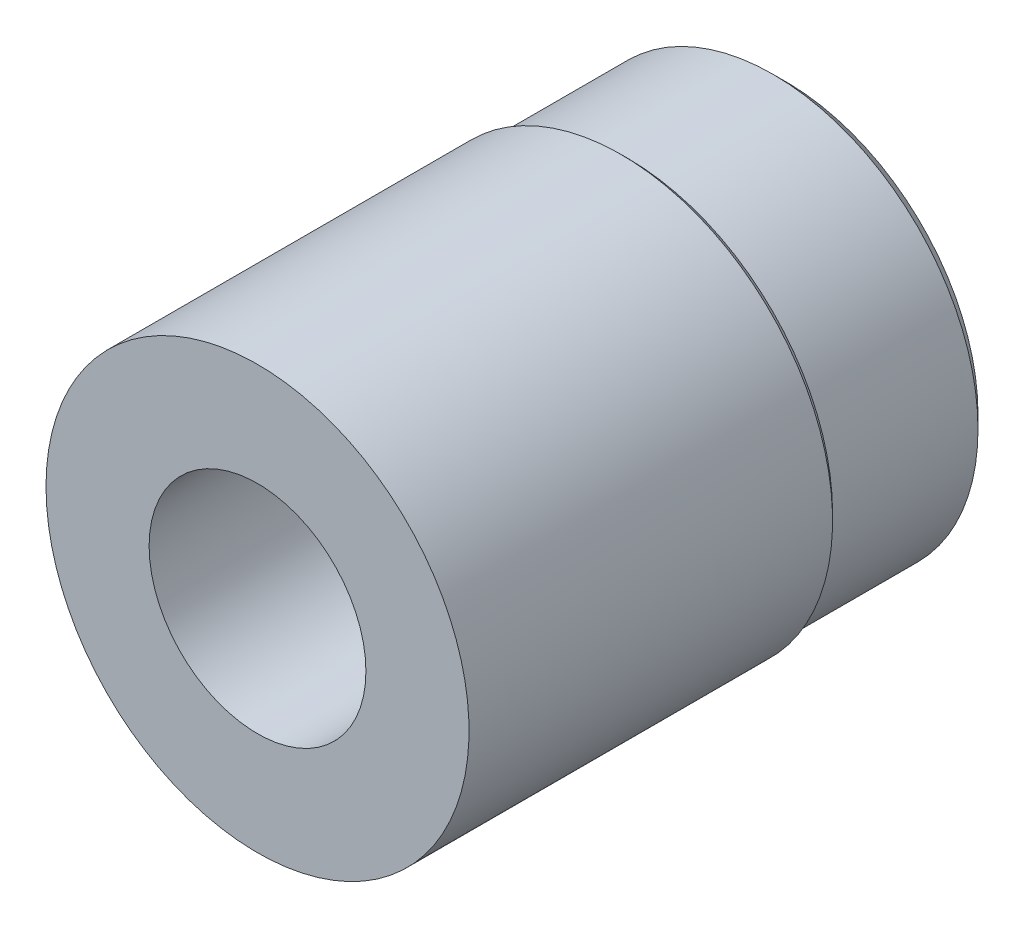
ISO-10303-21;
HEADER;
FILE_DESCRIPTION(('STEP AP214'),'2;1');
FILE_NAME('part.step','',(''),(''),'','','');
FILE_SCHEMA(('AUTOMOTIVE_DESIGN { 1 0 10303 214 1 1 1 1 }'));
ENDSEC;
DATA;
#1=APPLICATION_CONTEXT('core data for automotive mechanical design processes');
#2=APPLICATION_PROTOCOL_DEFINITION('international standard','automotive_design',2000,#1);
#3=PRODUCT_CONTEXT('',#1,'mechanical');
#4=PRODUCT('Part','Part','',(#3));
#5=PRODUCT_RELATED_PRODUCT_CATEGORY('part','',(#4));
#6=PRODUCT_DEFINITION_FORMATION('','',#4);
#7=PRODUCT_DEFINITION_CONTEXT('part definition',#1,'design');
#8=PRODUCT_DEFINITION('design','',#6,#7);
#9=PRODUCT_DEFINITION_SHAPE('','',#8);
#10=(LENGTH_UNIT() NAMED_UNIT(*) SI_UNIT(.MILLI.,.METRE.));
#11=(NAMED_UNIT(*) PLANE_ANGLE_UNIT() SI_UNIT($,.RADIAN.));
#12=(NAMED_UNIT(*) SI_UNIT($,.STERADIAN.) SOLID_ANGLE_UNIT());
#13=UNCERTAINTY_MEASURE_WITH_UNIT(LENGTH_MEASURE(1.E-05),#10,'distance_accuracy_value','');
#14=(GEOMETRIC_REPRESENTATION_CONTEXT(3) GLOBAL_UNCERTAINTY_ASSIGNED_CONTEXT((#13)) GLOBAL_UNIT_ASSIGNED_CONTEXT((#10,
#11,#12)) REPRESENTATION_CONTEXT('',''));
#15=CARTESIAN_POINT('',(0.,0.,0.));
#16=DIRECTION('',(0.,0.,1.));
#17=DIRECTION('',(1.,0.,0.));
#18=AXIS2_PLACEMENT_3D('',#15,#16,#17);
#19=CARTESIAN_POINT('',(0.,0.,-17.));
#20=DIRECTION('',(0.,0.,-1.));
#21=DIRECTION('',(-1.,0.,0.));
#22=AXIS2_PLACEMENT_3D('',#19,#20,#21);
#23=CYLINDRICAL_SURFACE('',#22,3.75000000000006);
#24=CARTESIAN_POINT('',(0.,0.,-14.));
#25=DIRECTION('',(0.,0.,-1.));
#26=DIRECTION('',(-1.,0.,0.));
#27=AXIS2_PLACEMENT_3D('',#24,#25,#26);
#28=CIRCLE('',#27,3.75000000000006);
#29=CARTESIAN_POINT('',(-3.75000000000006,0.,-14.));
#30=VERTEX_POINT('',#29);
#31=EDGE_CURVE('E17',#30,#30,#28,.T.);
#32=ORIENTED_EDGE('',*,*,#31,.F.);
#33=EDGE_LOOP('',(#32));
#34=FACE_BOUND('',#33,.T.);
#35=CARTESIAN_POINT('',(0.,0.,-20.));
#36=DIRECTION('',(0.,0.,-1.));
#37=DIRECTION('',(-1.,0.,0.));
#38=AXIS2_PLACEMENT_3D('',#35,#36,#37);
#39=CIRCLE('',#38,3.75000000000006);
#40=CARTESIAN_POINT('',(-3.75000000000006,0.,-20.));
#41=VERTEX_POINT('',#40);
#42=EDGE_CURVE('E47',#41,#41,#39,.F.);
#43=ORIENTED_EDGE('',*,*,#42,.F.);
#44=EDGE_LOOP('',(#43));
#45=FACE_BOUND('',#44,.T.);
#46=ADVANCED_FACE('F14',(#34,#45),#23,.F.);
#47=CARTESIAN_POINT('',(2.860576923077,0.,-14.));
#48=DIRECTION('',(0.,0.,-1.));
#49=DIRECTION('',(-1.,0.,0.));
#50=AXIS2_PLACEMENT_3D('',#47,#48,#49);
#51=PLANE('',#50);
#52=CARTESIAN_POINT('',(0.,0.,-14.));
#53=DIRECTION('',(0.,0.,-1.));
#54=DIRECTION('',(-1.,0.,0.));
#55=AXIS2_PLACEMENT_3D('',#52,#53,#54);
#56=CIRCLE('',#55,1.74890384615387);
#57=CARTESIAN_POINT('',(-1.74890384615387,0.,-14.));
#58=VERTEX_POINT('',#57);
#59=EDGE_CURVE('E45',#58,#58,#56,.F.);
#60=ORIENTED_EDGE('',*,*,#59,.T.);
#61=EDGE_LOOP('',(#60));
#62=FACE_BOUND('',#61,.T.);
#63=ORIENTED_EDGE('',*,*,#31,.T.);
#64=EDGE_LOOP('',(#63));
#65=FACE_BOUND('',#64,.T.);
#66=ADVANCED_FACE('F54',(#62,#65),#51,.T.);
#67=CARTESIAN_POINT('',(5.5,0.,-20.));
#68=DIRECTION('',(0.,0.,-1.));
#69=DIRECTION('',(-1.,0.,0.));
#70=AXIS2_PLACEMENT_3D('',#67,#68,#69);
#71=PLANE('',#70);
#72=ORIENTED_EDGE('',*,*,#42,.T.);
#73=EDGE_LOOP('',(#72));
#74=FACE_BOUND('',#73,.T.);
#75=CARTESIAN_POINT('',(0.,0.,-20.0000000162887));
#76=DIRECTION('',(0.,0.,1.));
#77=DIRECTION('',(1.,0.,0.));
#78=AXIS2_PLACEMENT_3D('',#75,#76,#77);
#79=CIRCLE('',#78,7.25000001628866);
#80=CARTESIAN_POINT('',(7.25000001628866,0.,-20.0000000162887));
#81=VERTEX_POINT('',#80);
#82=EDGE_CURVE('E42',#81,#81,#79,.T.);
#83=ORIENTED_EDGE('',*,*,#82,.F.);
#84=EDGE_LOOP('',(#83));
#85=FACE_BOUND('',#84,.T.);
#86=ADVANCED_FACE('F63',(#74,#85),#71,.T.);
#87=CARTESIAN_POINT('',(0.,0.,-12.8790322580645));
#88=DIRECTION('',(0.,0.,-1.));
#89=DIRECTION('',(-1.,0.,0.));
#90=AXIS2_PLACEMENT_3D('',#87,#88,#89);
#91=CYLINDRICAL_SURFACE('',#90,1.74890384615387);
#92=CARTESIAN_POINT('',(0.,0.,-11.758064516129));
#93=DIRECTION('',(0.,0.,-1.));
#94=DIRECTION('',(-1.,0.,0.));
#95=AXIS2_PLACEMENT_3D('',#92,#93,#94);
#96=CIRCLE('',#95,1.74890384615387);
#97=CARTESIAN_POINT('',(-1.74890384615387,0.,-11.758064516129));
#98=VERTEX_POINT('',#97);
#99=EDGE_CURVE('E39',#98,#98,#96,.T.);
#100=ORIENTED_EDGE('',*,*,#99,.F.);
#101=EDGE_LOOP('',(#100));
#102=FACE_BOUND('',#101,.T.);
#103=ORIENTED_EDGE('',*,*,#59,.F.);
#104=EDGE_LOOP('',(#103));
#105=FACE_BOUND('',#104,.T.);
#106=ADVANCED_FACE('F96',(#102,#105),#91,.F.);
#107=CARTESIAN_POINT('',(0.,0.,-19.50000001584));
#108=DIRECTION('',(0.,0.,1.));
#109=DIRECTION('',(1.,0.,0.));
#110=AXIS2_PLACEMENT_3D('',#107,#108,#109);
#111=CONICAL_SURFACE('',#110,7.75000001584,0.785398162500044);
#112=CARTESIAN_POINT('',(0.,0.,-19.5));
#113=DIRECTION('',(0.,0.,-1.));
#114=DIRECTION('',(-1.,0.,0.));
#115=AXIS2_PLACEMENT_3D('',#112,#113,#114);
#116=CIRCLE('',#115,7.75);
#117=CARTESIAN_POINT('',(-7.75,0.,-19.5));
#118=VERTEX_POINT('',#117);
#119=EDGE_CURVE('E38',#118,#118,#116,.F.);
#120=ORIENTED_EDGE('',*,*,#119,.F.);
#121=EDGE_LOOP('',(#120));
#122=FACE_BOUND('',#121,.T.);
#123=ORIENTED_EDGE('',*,*,#82,.T.);
#124=EDGE_LOOP('',(#123));
#125=FACE_BOUND('',#124,.T.);
#126=ADVANCED_FACE('F92',(#122,#125),#111,.T.);
#127=CARTESIAN_POINT('',(3.03557692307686,0.,-11.758064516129));
#128=DIRECTION('',(0.,0.,1.));
#129=DIRECTION('',(1.,0.,0.));
#130=AXIS2_PLACEMENT_3D('',#127,#128,#129);
#131=PLANE('',#130);
#132=ORIENTED_EDGE('',*,*,#99,.T.);
#133=EDGE_LOOP('',(#132));
#134=FACE_BOUND('',#133,.T.);
#135=CARTESIAN_POINT('',(0.,0.,-11.758064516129));
#136=DIRECTION('',(0.,0.,-1.));
#137=DIRECTION('',(-1.,0.,0.));
#138=AXIS2_PLACEMENT_3D('',#135,#136,#137);
#139=CIRCLE('',#138,4.1);
#140=CARTESIAN_POINT('',(-4.1,0.,-11.758064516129));
#141=VERTEX_POINT('',#140);
#142=EDGE_CURVE('E35',#141,#141,#139,.F.);
#143=ORIENTED_EDGE('',*,*,#142,.T.);
#144=EDGE_LOOP('',(#143));
#145=FACE_BOUND('',#144,.T.);
#146=ADVANCED_FACE('F88',(#134,#145),#131,.T.);
#147=CARTESIAN_POINT('',(0.,0.,-16.75));
#148=DIRECTION('',(0.,0.,-1.));
#149=DIRECTION('',(-1.,0.,0.));
#150=AXIS2_PLACEMENT_3D('',#147,#148,#149);
#151=CYLINDRICAL_SURFACE('',#150,7.75);
#152=CARTESIAN_POINT('',(0.,0.,-14.0000000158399));
#153=DIRECTION('',(0.,0.,1.));
#154=DIRECTION('',(1.,0.,0.));
#155=AXIS2_PLACEMENT_3D('',#152,#153,#154);
#156=CIRCLE('',#155,7.75000001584);
#157=CARTESIAN_POINT('',(7.75000001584,0.,-14.0000000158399));
#158=VERTEX_POINT('',#157);
#159=EDGE_CURVE('E34',#158,#158,#156,.T.);
#160=ORIENTED_EDGE('',*,*,#159,.F.);
#161=EDGE_LOOP('',(#160));
#162=FACE_BOUND('',#161,.T.);
#163=ORIENTED_EDGE('',*,*,#119,.T.);
#164=EDGE_LOOP('',(#163));
#165=FACE_BOUND('',#164,.T.);
#166=ADVANCED_FACE('F84',(#162,#165),#151,.T.);
#167=CARTESIAN_POINT('',(0.,0.,-5.8790322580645));
#168=DIRECTION('',(0.,0.,-1.));
#169=DIRECTION('',(-1.,0.,0.));
#170=AXIS2_PLACEMENT_3D('',#167,#168,#169);
#171=CYLINDRICAL_SURFACE('',#170,4.1);
#172=CARTESIAN_POINT('',(0.,0.,0.));
#173=DIRECTION('',(0.,0.,-1.));
#174=DIRECTION('',(-1.,0.,0.));
#175=AXIS2_PLACEMENT_3D('',#172,#173,#174);
#176=CIRCLE('',#175,4.1);
#177=CARTESIAN_POINT('',(-4.1,0.,0.));
#178=VERTEX_POINT('',#177);
#179=EDGE_CURVE('E26',#178,#178,#176,.T.);
#180=ORIENTED_EDGE('',*,*,#179,.F.);
#181=EDGE_LOOP('',(#180));
#182=FACE_BOUND('',#181,.T.);
#183=ORIENTED_EDGE('',*,*,#142,.F.);
#184=EDGE_LOOP('',(#183));
#185=FACE_BOUND('',#184,.T.);
#186=ADVANCED_FACE('F80',(#182,#185),#171,.F.);
#187=CARTESIAN_POINT('',(0.,0.,-13.7500000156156));
#188=DIRECTION('',(0.,0.,1.));
#189=DIRECTION('',(0.,-1.,0.));
#190=AXIS2_PLACEMENT_3D('',#187,#188,#189);
#191=CONICAL_SURFACE('',#190,8.00000001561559,0.785398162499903);
#192=CARTESIAN_POINT('',(0.,0.,-13.75));
#193=DIRECTION('',(0.,0.,-1.));
#194=DIRECTION('',(-1.,0.,0.));
#195=AXIS2_PLACEMENT_3D('',#192,#193,#194);
#196=CIRCLE('',#195,8.);
#197=CARTESIAN_POINT('',(-8.,0.,-13.75));
#198=VERTEX_POINT('',#197);
#199=EDGE_CURVE('E21',#198,#198,#196,.F.);
#200=ORIENTED_EDGE('',*,*,#199,.F.);
#201=EDGE_LOOP('',(#200));
#202=FACE_BOUND('',#201,.T.);
#203=ORIENTED_EDGE('',*,*,#159,.T.);
#204=EDGE_LOOP('',(#203));
#205=FACE_BOUND('',#204,.T.);
#206=ADVANCED_FACE('F73',(#202,#205),#191,.T.);
#207=CARTESIAN_POINT('',(6.05,0.,0.));
#208=DIRECTION('',(0.,0.,1.));
#209=DIRECTION('',(1.,0.,0.));
#210=AXIS2_PLACEMENT_3D('',#207,#208,#209);
#211=PLANE('',#210);
#212=CARTESIAN_POINT('',(0.,0.,0.));
#213=DIRECTION('',(0.,0.,-1.));
#214=DIRECTION('',(-1.,0.,0.));
#215=AXIS2_PLACEMENT_3D('',#212,#213,#214);
#216=CIRCLE('',#215,8.);
#217=CARTESIAN_POINT('',(-8.,0.,0.));
#218=VERTEX_POINT('',#217);
#219=EDGE_CURVE('E9',#218,#218,#216,.T.);
#220=ORIENTED_EDGE('',*,*,#219,.F.);
#221=EDGE_LOOP('',(#220));
#222=FACE_BOUND('',#221,.T.);
#223=ORIENTED_EDGE('',*,*,#179,.T.);
#224=EDGE_LOOP('',(#223));
#225=FACE_BOUND('',#224,.T.);
#226=ADVANCED_FACE('F67',(#222,#225),#211,.T.);
#227=CARTESIAN_POINT('',(0.,0.,-6.875));
#228=DIRECTION('',(0.,0.,-1.));
#229=DIRECTION('',(-1.,0.,0.));
#230=AXIS2_PLACEMENT_3D('',#227,#228,#229);
#231=CYLINDRICAL_SURFACE('',#230,8.);
#232=ORIENTED_EDGE('',*,*,#219,.T.);
#233=EDGE_LOOP('',(#232));
#234=FACE_BOUND('',#233,.T.);
#235=ORIENTED_EDGE('',*,*,#199,.T.);
#236=EDGE_LOOP('',(#235));
#237=FACE_BOUND('',#236,.T.);
#238=ADVANCED_FACE('F65',(#234,#237),#231,.T.);
#239=CLOSED_SHELL('',(#46,#66,#86,#106,#126,#146,#166,#186,#206,#226,#238));
#240=MANIFOLD_SOLID_BREP('B1',#239);
#241=ADVANCED_BREP_SHAPE_REPRESENTATION('',(#18,#240),#14);
#242=SHAPE_DEFINITION_REPRESENTATION(#9,#241);
ENDSEC;
END-ISO-10303-21;
